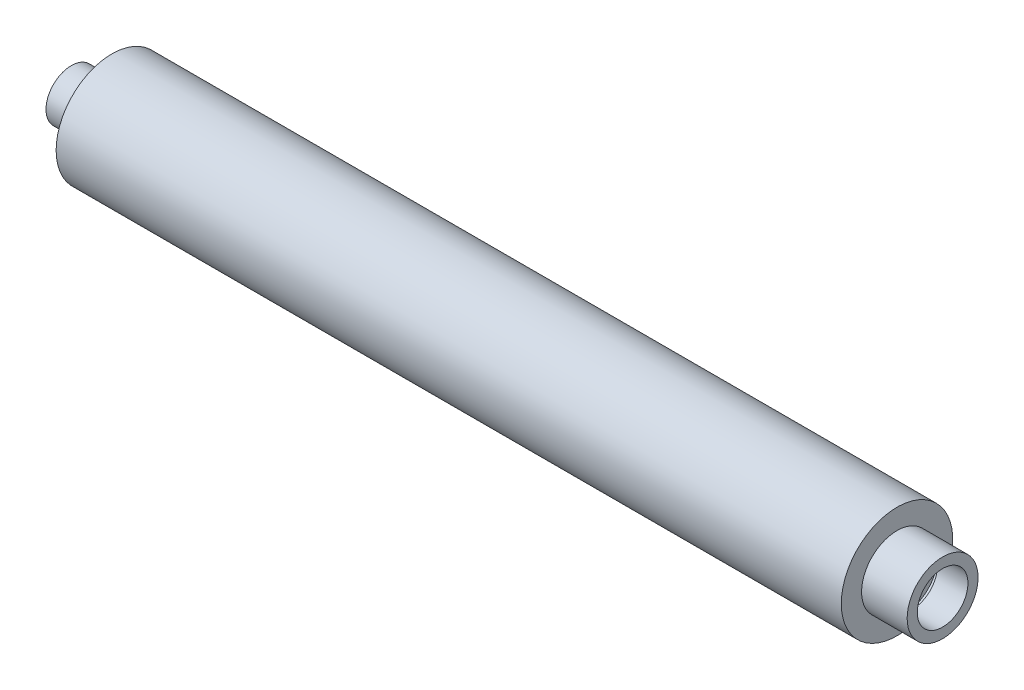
from build123d import *


with BuildPart() as part:
    # Esquisse1 → Base-R_volution (revolve)
    with BuildSketch(Plane.XY, mode=Mode.PRIVATE) as base_r_volution_sk:
        Polygon((-38, 0), (-38, 5), (-30, 5), (-30, 11), (125, 11), (125, 7), (134, 7), (134, 5), (128, 5), (128, 6.5), (126.5, 6.5), (126.5, 5), (124, 5), (124, 10), (-29, 10), (-29, 0), align=None)
    revolve(base_r_volution_sk.sketch.rotate(Axis((-50, 0, 0), (1, 0, 0)), 90), axis=Axis((-50, 0, 0), (1, 0, 0)))


solid = part.part
